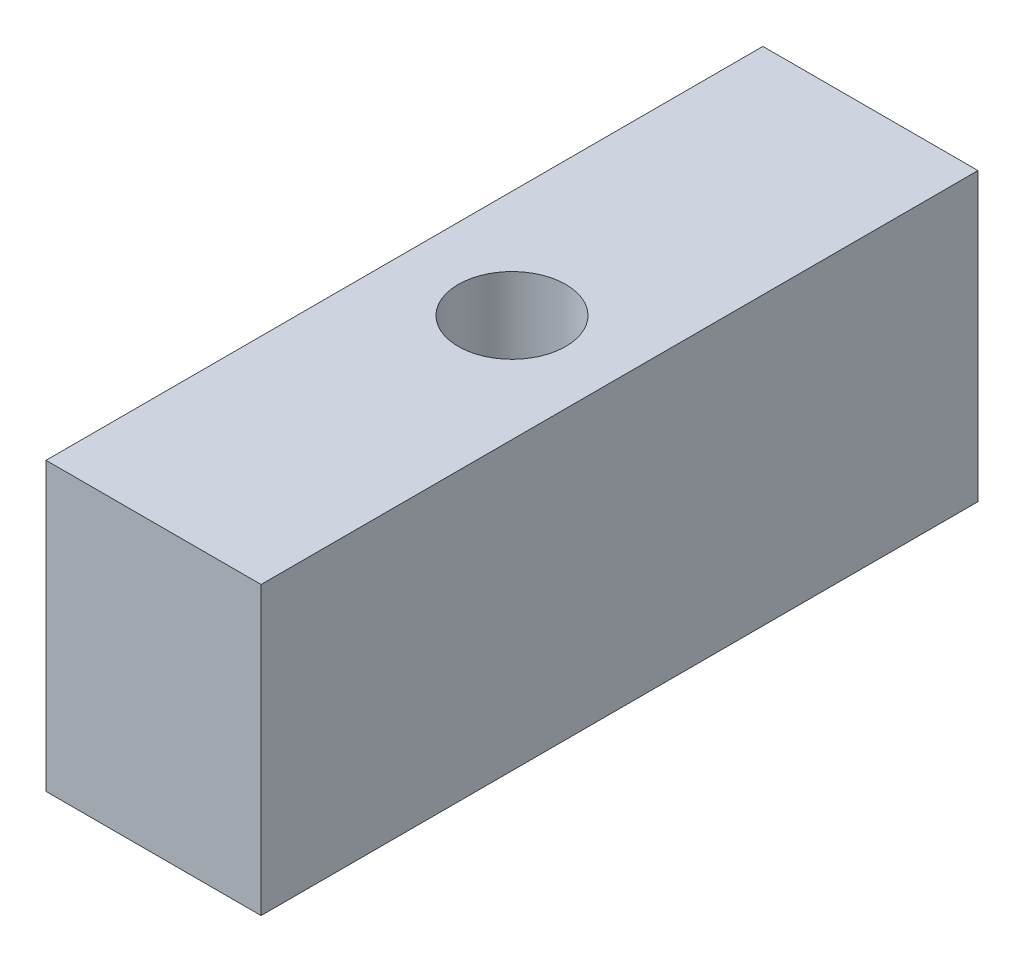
from build123d import *

# Parameters (mm, degrees)
ESQUISSE1_W             = 3
ESQUISSE1_H             = 4
BASE_EXTRUSION_DEPTH    = 10
ESQUISSE2_R             = 0.75
ENL_V_MAT_EXTRU_1_DEPTH = 12.180339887


with BuildPart() as part:
    # Esquisse1 → Base-Extrusion (new body)
    with BuildSketch(Plane.XY):
        with Locations((1.5, 2)):
            Rectangle(ESQUISSE1_W, ESQUISSE1_H)
    extrude(amount=BASE_EXTRUSION_DEPTH)

    # Esquisse2 → Enl_v. mat.-Extru.1 (cut, through all)
    with BuildSketch(Plane.XZ):
        with Locations(Location((1.5, 5, 0), (0, 0, 270))):
            Circle(ESQUISSE2_R)
    extrude(amount=-ENL_V_MAT_EXTRU_1_DEPTH, mode=Mode.SUBTRACT)


solid = part.part
